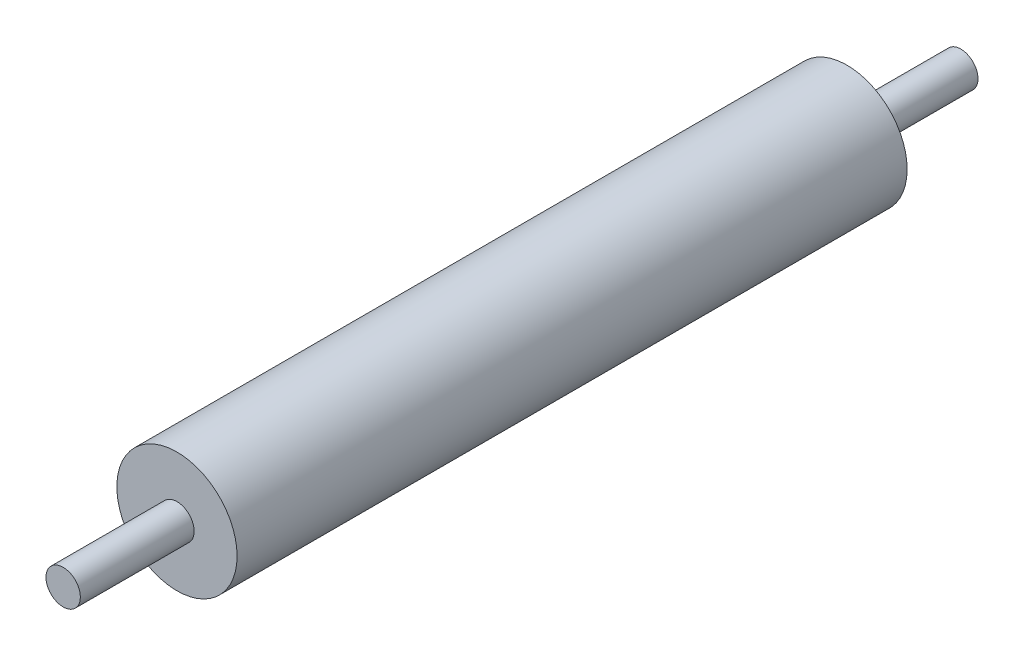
from build123d import *

# Parameters (mm, degrees)
SKETCH_1_R      = 70
EXTRUDE_1_DEPTH = 390
SKETCH_2_R      = 20
EXTRUDE_2_DEPTH = 132.5
EXTRUDE_START   = 132.5
SKETCH_3_R      = 20
EXTRUDE_3_DEPTH = 132.5


with BuildPart() as part:
    # Sketch 1 → Extrude 1 (new, symmetric)
    with BuildSketch(Plane.XY):
        Circle(SKETCH_1_R)
    extrude(amount=EXTRUDE_1_DEPTH, both=True)

    # Sketch 2 → Extrude 2 (add)
    with BuildSketch(Plane.XY.offset(390)):
        Circle(SKETCH_2_R)
    extrude(amount=EXTRUDE_2_DEPTH)

    # Sketch 3 → Extrude 3 (add)
    with BuildSketch(Plane(origin=(0, 0, -390), x_dir=(-1, 0, 0), z_dir=(0, 0, -1)).offset(EXTRUDE_START)):
        with Locations(Location((0, 0, 0), (0, 0, 180))):
            Circle(SKETCH_3_R)
    extrude(amount=-EXTRUDE_3_DEPTH)


solid = part.part
